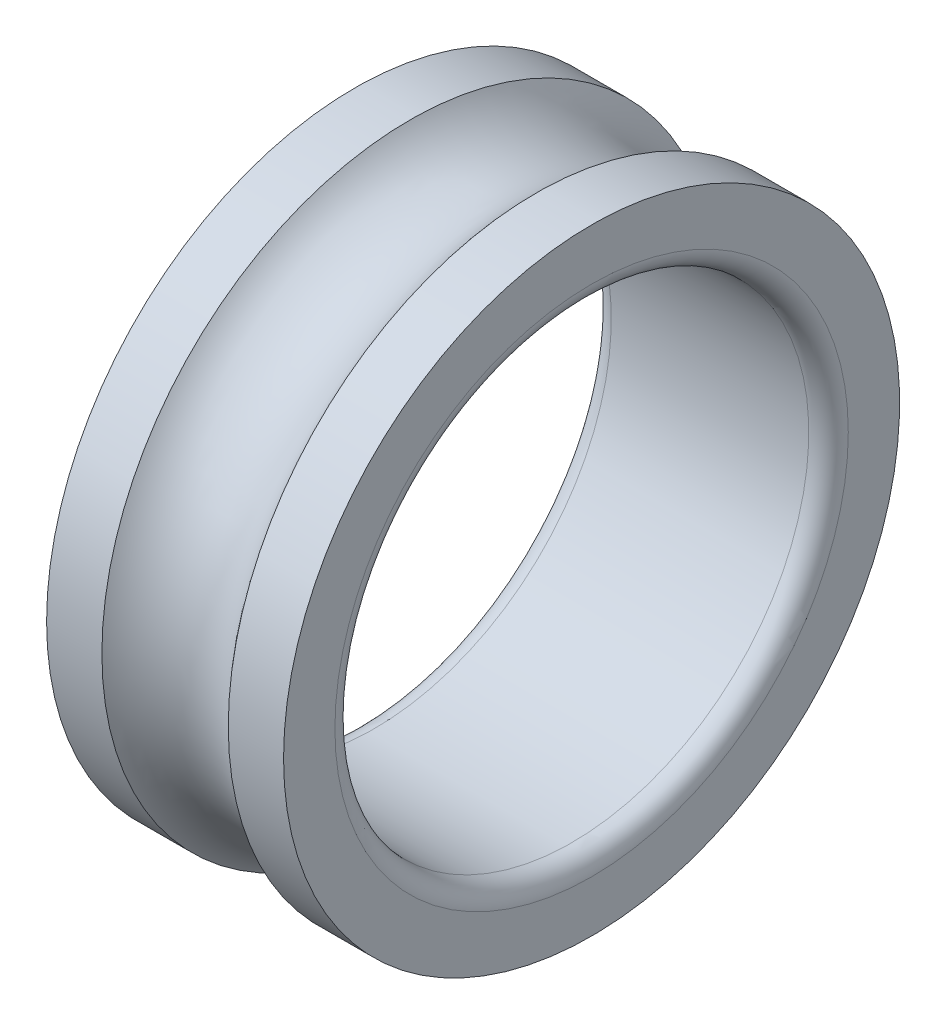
ISO-10303-21;
HEADER;
FILE_DESCRIPTION(('STEP AP214'),'2;1');
FILE_NAME('part.step','',(''),(''),'','','');
FILE_SCHEMA(('AUTOMOTIVE_DESIGN { 1 0 10303 214 1 1 1 1 }'));
ENDSEC;
DATA;
#1=APPLICATION_CONTEXT('core data for automotive mechanical design processes');
#2=APPLICATION_PROTOCOL_DEFINITION('international standard','automotive_design',2000,#1);
#3=PRODUCT_CONTEXT('',#1,'mechanical');
#4=PRODUCT('Part','Part','',(#3));
#5=PRODUCT_RELATED_PRODUCT_CATEGORY('part','',(#4));
#6=PRODUCT_DEFINITION_FORMATION('','',#4);
#7=PRODUCT_DEFINITION_CONTEXT('part definition',#1,'design');
#8=PRODUCT_DEFINITION('design','',#6,#7);
#9=PRODUCT_DEFINITION_SHAPE('','',#8);
#10=(LENGTH_UNIT() NAMED_UNIT(*) SI_UNIT(.MILLI.,.METRE.));
#11=(NAMED_UNIT(*) PLANE_ANGLE_UNIT() SI_UNIT($,.RADIAN.));
#12=(NAMED_UNIT(*) SI_UNIT($,.STERADIAN.) SOLID_ANGLE_UNIT());
#13=UNCERTAINTY_MEASURE_WITH_UNIT(LENGTH_MEASURE(1.E-05),#10,'distance_accuracy_value','');
#14=(GEOMETRIC_REPRESENTATION_CONTEXT(3) GLOBAL_UNCERTAINTY_ASSIGNED_CONTEXT((#13)) GLOBAL_UNIT_ASSIGNED_CONTEXT((#10,
#11,#12)) REPRESENTATION_CONTEXT('',''));
#15=CARTESIAN_POINT('',(0.,0.,0.));
#16=DIRECTION('',(0.,0.,1.));
#17=DIRECTION('',(1.,0.,0.));
#18=AXIS2_PLACEMENT_3D('',#15,#16,#17);
#19=CARTESIAN_POINT('',(2.5,0.,0.));
#20=DIRECTION('',(-1.,0.,0.));
#21=DIRECTION('',(0.,0.,1.));
#22=AXIS2_PLACEMENT_3D('',#19,#20,#21);
#23=TOROIDAL_SURFACE('',#22,6.5,0.5);
#24=CARTESIAN_POINT('',(3.,0.,0.));
#25=DIRECTION('',(-1.,0.,0.));
#26=DIRECTION('',(0.,0.,1.));
#27=AXIS2_PLACEMENT_3D('',#24,#25,#26);
#28=CIRCLE('',#27,6.5);
#29=CARTESIAN_POINT('',(3.,0.,6.5));
#30=VERTEX_POINT('',#29);
#31=EDGE_CURVE('E60',#30,#30,#28,.T.);
#32=ORIENTED_EDGE('',*,*,#31,.F.);
#33=EDGE_LOOP('',(#32));
#34=FACE_BOUND('',#33,.T.);
#35=CARTESIAN_POINT('',(2.5,0.,0.));
#36=DIRECTION('',(-1.,0.,0.));
#37=DIRECTION('',(0.,0.,1.));
#38=AXIS2_PLACEMENT_3D('',#35,#36,#37);
#39=CIRCLE('',#38,6.);
#40=CARTESIAN_POINT('',(2.5,0.,6.));
#41=VERTEX_POINT('',#40);
#42=EDGE_CURVE('E10',#41,#41,#39,.T.);
#43=ORIENTED_EDGE('',*,*,#42,.T.);
#44=EDGE_LOOP('',(#43));
#45=FACE_BOUND('',#44,.T.);
#46=ADVANCED_FACE('F32',(#34,#45),#23,.T.);
#47=CARTESIAN_POINT('',(-4.37090809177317,0.,0.));
#48=DIRECTION('',(-1.,0.,0.));
#49=DIRECTION('',(0.,0.,1.));
#50=AXIS2_PLACEMENT_3D('',#47,#48,#49);
#51=CYLINDRICAL_SURFACE('',#50,6.);
#52=ORIENTED_EDGE('',*,*,#42,.F.);
#53=EDGE_LOOP('',(#52));
#54=FACE_BOUND('',#53,.T.);
#55=CARTESIAN_POINT('',(-2.5,0.,0.));
#56=DIRECTION('',(-1.,0.,0.));
#57=DIRECTION('',(0.,0.,1.));
#58=AXIS2_PLACEMENT_3D('',#55,#56,#57);
#59=CIRCLE('',#58,6.);
#60=CARTESIAN_POINT('',(-2.5,0.,6.));
#61=VERTEX_POINT('',#60);
#62=EDGE_CURVE('E38',#61,#61,#59,.T.);
#63=ORIENTED_EDGE('',*,*,#62,.T.);
#64=EDGE_LOOP('',(#63));
#65=FACE_BOUND('',#64,.T.);
#66=ADVANCED_FACE('F67',(#54,#65),#51,.F.);
#67=CARTESIAN_POINT('',(-2.5,0.,0.));
#68=DIRECTION('',(-1.,0.,0.));
#69=DIRECTION('',(0.,0.,1.));
#70=AXIS2_PLACEMENT_3D('',#67,#68,#69);
#71=TOROIDAL_SURFACE('',#70,6.5,0.5);
#72=ORIENTED_EDGE('',*,*,#62,.F.);
#73=EDGE_LOOP('',(#72));
#74=FACE_BOUND('',#73,.T.);
#75=CARTESIAN_POINT('',(-3.,0.,0.));
#76=DIRECTION('',(-1.,0.,0.));
#77=DIRECTION('',(0.,0.,1.));
#78=AXIS2_PLACEMENT_3D('',#75,#76,#77);
#79=CIRCLE('',#78,6.5);
#80=CARTESIAN_POINT('',(-3.,0.,6.5));
#81=VERTEX_POINT('',#80);
#82=EDGE_CURVE('E42',#81,#81,#79,.T.);
#83=ORIENTED_EDGE('',*,*,#82,.T.);
#84=EDGE_LOOP('',(#83));
#85=FACE_BOUND('',#84,.T.);
#86=ADVANCED_FACE('F71',(#74,#85),#71,.T.);
#87=CARTESIAN_POINT('',(-3.,6.5,0.));
#88=DIRECTION('',(1.,0.,0.));
#89=DIRECTION('',(0.,0.,-1.));
#90=AXIS2_PLACEMENT_3D('',#87,#88,#89);
#91=PLANE('',#90);
#92=ORIENTED_EDGE('',*,*,#82,.F.);
#93=EDGE_LOOP('',(#92));
#94=FACE_BOUND('',#93,.T.);
#95=CARTESIAN_POINT('',(-3.,0.,0.));
#96=DIRECTION('',(-1.,0.,0.));
#97=DIRECTION('',(0.,0.,1.));
#98=AXIS2_PLACEMENT_3D('',#95,#96,#97);
#99=CIRCLE('',#98,7.8);
#100=CARTESIAN_POINT('',(-3.,0.,7.8));
#101=VERTEX_POINT('',#100);
#102=EDGE_CURVE('E46',#101,#101,#99,.T.);
#103=ORIENTED_EDGE('',*,*,#102,.T.);
#104=EDGE_LOOP('',(#103));
#105=FACE_BOUND('',#104,.T.);
#106=ADVANCED_FACE('F76',(#94,#105),#91,.F.);
#107=CARTESIAN_POINT('',(-4.37090809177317,0.,0.));
#108=DIRECTION('',(-1.,0.,0.));
#109=DIRECTION('',(0.,0.,1.));
#110=AXIS2_PLACEMENT_3D('',#107,#108,#109);
#111=CYLINDRICAL_SURFACE('',#110,7.8);
#112=ORIENTED_EDGE('',*,*,#102,.F.);
#113=EDGE_LOOP('',(#112));
#114=FACE_BOUND('',#113,.T.);
#115=CARTESIAN_POINT('',(-1.6,0.,0.));
#116=DIRECTION('',(-1.,0.,0.));
#117=DIRECTION('',(0.,0.,1.));
#118=AXIS2_PLACEMENT_3D('',#115,#116,#117);
#119=CIRCLE('',#118,7.8);
#120=CARTESIAN_POINT('',(-1.6,0.,7.8));
#121=VERTEX_POINT('',#120);
#122=EDGE_CURVE('E51',#121,#121,#119,.T.);
#123=ORIENTED_EDGE('',*,*,#122,.T.);
#124=EDGE_LOOP('',(#123));
#125=FACE_BOUND('',#124,.T.);
#126=ADVANCED_FACE('F82',(#114,#125),#111,.T.);
#127=CARTESIAN_POINT('',(0.,0.,0.));
#128=DIRECTION('',(-1.,0.,0.));
#129=DIRECTION('',(0.,0.,1.));
#130=AXIS2_PLACEMENT_3D('',#127,#128,#129);
#131=TOROIDAL_SURFACE('',#130,9.,2.);
#132=ORIENTED_EDGE('',*,*,#122,.F.);
#133=EDGE_LOOP('',(#132));
#134=FACE_BOUND('',#133,.T.);
#135=CARTESIAN_POINT('',(1.6,0.,0.));
#136=DIRECTION('',(-1.,0.,0.));
#137=DIRECTION('',(0.,0.,1.));
#138=AXIS2_PLACEMENT_3D('',#135,#136,#137);
#139=CIRCLE('',#138,7.8);
#140=CARTESIAN_POINT('',(1.6,0.,7.8));
#141=VERTEX_POINT('',#140);
#142=EDGE_CURVE('E54',#141,#141,#139,.T.);
#143=ORIENTED_EDGE('',*,*,#142,.T.);
#144=EDGE_LOOP('',(#143));
#145=FACE_BOUND('',#144,.T.);
#146=ADVANCED_FACE('F86',(#134,#145),#131,.F.);
#147=CARTESIAN_POINT('',(-4.37090809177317,0.,0.));
#148=DIRECTION('',(-1.,0.,0.));
#149=DIRECTION('',(0.,0.,1.));
#150=AXIS2_PLACEMENT_3D('',#147,#148,#149);
#151=CYLINDRICAL_SURFACE('',#150,7.8);
#152=ORIENTED_EDGE('',*,*,#142,.F.);
#153=EDGE_LOOP('',(#152));
#154=FACE_BOUND('',#153,.T.);
#155=CARTESIAN_POINT('',(3.,0.,0.));
#156=DIRECTION('',(-1.,0.,0.));
#157=DIRECTION('',(0.,0.,1.));
#158=AXIS2_PLACEMENT_3D('',#155,#156,#157);
#159=CIRCLE('',#158,7.8);
#160=CARTESIAN_POINT('',(3.,0.,7.8));
#161=VERTEX_POINT('',#160);
#162=EDGE_CURVE('E57',#161,#161,#159,.T.);
#163=ORIENTED_EDGE('',*,*,#162,.T.);
#164=EDGE_LOOP('',(#163));
#165=FACE_BOUND('',#164,.T.);
#166=ADVANCED_FACE('F90',(#154,#165),#151,.T.);
#167=CARTESIAN_POINT('',(3.,6.5,0.));
#168=DIRECTION('',(-1.,0.,0.));
#169=DIRECTION('',(0.,0.,1.));
#170=AXIS2_PLACEMENT_3D('',#167,#168,#169);
#171=PLANE('',#170);
#172=ORIENTED_EDGE('',*,*,#162,.F.);
#173=EDGE_LOOP('',(#172));
#174=FACE_BOUND('',#173,.T.);
#175=ORIENTED_EDGE('',*,*,#31,.T.);
#176=EDGE_LOOP('',(#175));
#177=FACE_BOUND('',#176,.T.);
#178=ADVANCED_FACE('F64',(#174,#177),#171,.F.);
#179=CLOSED_SHELL('',(#46,#66,#86,#106,#126,#146,#166,#178));
#180=MANIFOLD_SOLID_BREP('B2',#179);
#181=ADVANCED_BREP_SHAPE_REPRESENTATION('',(#18,#180),#14);
#182=SHAPE_DEFINITION_REPRESENTATION(#9,#181);
ENDSEC;
END-ISO-10303-21;
